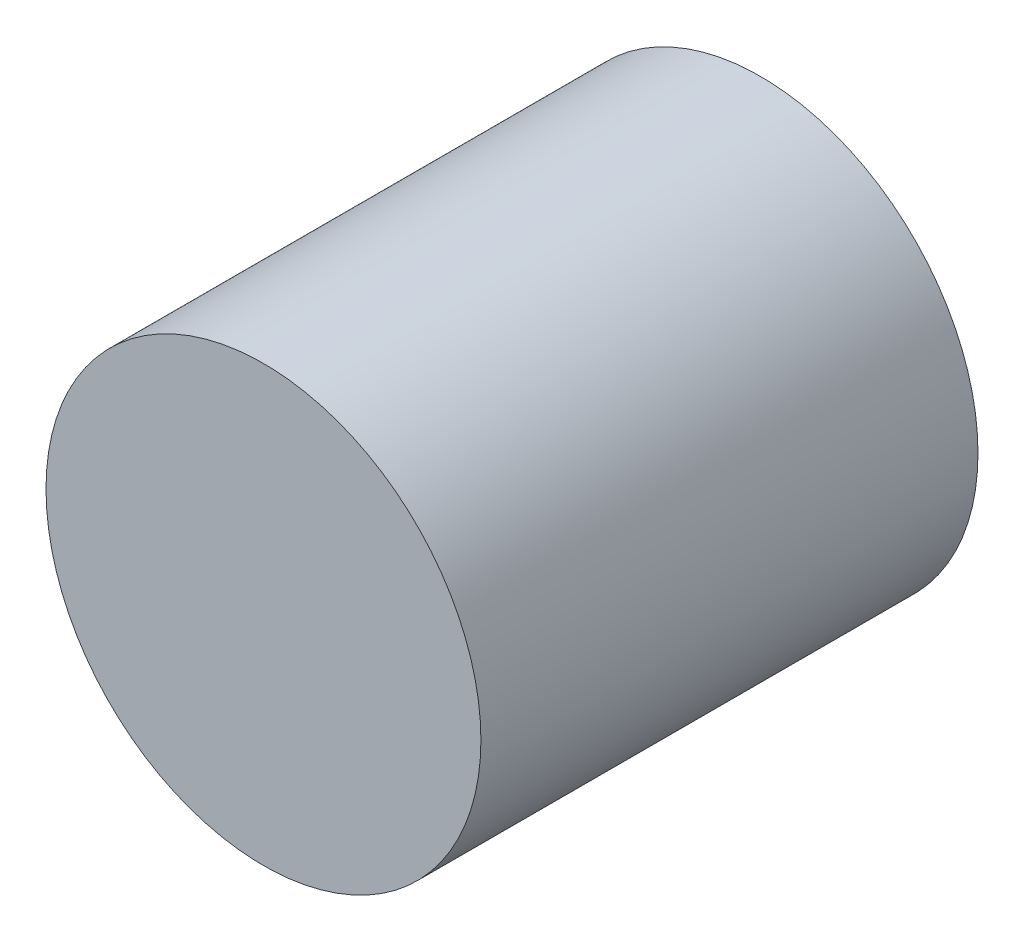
ISO-10303-21;
HEADER;
FILE_DESCRIPTION(('STEP AP214'),'2;1');
FILE_NAME('part.step','',(''),(''),'','','');
FILE_SCHEMA(('AUTOMOTIVE_DESIGN { 1 0 10303 214 1 1 1 1 }'));
ENDSEC;
DATA;
#1=APPLICATION_CONTEXT('core data for automotive mechanical design processes');
#2=APPLICATION_PROTOCOL_DEFINITION('international standard','automotive_design',2000,#1);
#3=PRODUCT_CONTEXT('',#1,'mechanical');
#4=PRODUCT('Part','Part','',(#3));
#5=PRODUCT_RELATED_PRODUCT_CATEGORY('part','',(#4));
#6=PRODUCT_DEFINITION_FORMATION('','',#4);
#7=PRODUCT_DEFINITION_CONTEXT('part definition',#1,'design');
#8=PRODUCT_DEFINITION('design','',#6,#7);
#9=PRODUCT_DEFINITION_SHAPE('','',#8);
#10=(LENGTH_UNIT() NAMED_UNIT(*) SI_UNIT(.MILLI.,.METRE.));
#11=(NAMED_UNIT(*) PLANE_ANGLE_UNIT() SI_UNIT($,.RADIAN.));
#12=(NAMED_UNIT(*) SI_UNIT($,.STERADIAN.) SOLID_ANGLE_UNIT());
#13=UNCERTAINTY_MEASURE_WITH_UNIT(LENGTH_MEASURE(1.E-05),#10,'distance_accuracy_value','');
#14=(GEOMETRIC_REPRESENTATION_CONTEXT(3) GLOBAL_UNCERTAINTY_ASSIGNED_CONTEXT((#13)) GLOBAL_UNIT_ASSIGNED_CONTEXT((#10,
#11,#12)) REPRESENTATION_CONTEXT('',''));
#15=CARTESIAN_POINT('',(0.,0.,0.));
#16=DIRECTION('',(0.,0.,1.));
#17=DIRECTION('',(1.,0.,0.));
#18=AXIS2_PLACEMENT_3D('',#15,#16,#17);
#19=CARTESIAN_POINT('',(0.,0.,0.));
#20=DIRECTION('',(0.,0.,1.));
#21=DIRECTION('',(1.,0.,0.));
#22=AXIS2_PLACEMENT_3D('',#19,#20,#21);
#23=PLANE('',#22);
#24=CARTESIAN_POINT('',(0.,5.08,0.));
#25=DIRECTION('',(0.,0.,1.));
#26=DIRECTION('',(1.,0.,0.));
#27=AXIS2_PLACEMENT_3D('',#24,#25,#26);
#28=CIRCLE('',#27,0.889);
#29=CARTESIAN_POINT('',(0.889,5.08,0.));
#30=VERTEX_POINT('',#29);
#31=EDGE_CURVE('E36',#30,#30,#28,.F.);
#32=ORIENTED_EDGE('',*,*,#31,.F.);
#33=EDGE_LOOP('',(#32));
#34=FACE_BOUND('',#33,.T.);
#35=CARTESIAN_POINT('',(0.,0.,0.));
#36=DIRECTION('',(0.,0.,1.));
#37=DIRECTION('',(1.,0.,0.));
#38=AXIS2_PLACEMENT_3D('',#35,#36,#37);
#39=CIRCLE('',#38,17.5006);
#40=CARTESIAN_POINT('',(17.5006,0.,0.));
#41=VERTEX_POINT('',#40);
#42=EDGE_CURVE('E44',#41,#41,#39,.T.);
#43=ORIENTED_EDGE('',*,*,#42,.F.);
#44=EDGE_LOOP('',(#43));
#45=FACE_BOUND('',#44,.T.);
#46=CARTESIAN_POINT('',(0.,-5.08,0.));
#47=DIRECTION('',(0.,0.,1.));
#48=DIRECTION('',(1.,0.,0.));
#49=AXIS2_PLACEMENT_3D('',#46,#47,#48);
#50=CIRCLE('',#49,0.889);
#51=CARTESIAN_POINT('',(0.889,-5.08,0.));
#52=VERTEX_POINT('',#51);
#53=EDGE_CURVE('E10',#52,#52,#50,.F.);
#54=ORIENTED_EDGE('',*,*,#53,.F.);
#55=EDGE_LOOP('',(#54));
#56=FACE_BOUND('',#55,.T.);
#57=ADVANCED_FACE('F29',(#34,#45,#56),#23,.F.);
#58=CARTESIAN_POINT('',(0.,0.,40.005));
#59=DIRECTION('',(0.,0.,-1.));
#60=DIRECTION('',(-1.,0.,0.));
#61=AXIS2_PLACEMENT_3D('',#58,#59,#60);
#62=CYLINDRICAL_SURFACE('',#61,17.5006);
#63=CARTESIAN_POINT('',(0.,0.,40.005));
#64=DIRECTION('',(0.,0.,1.));
#65=DIRECTION('',(1.,0.,0.));
#66=AXIS2_PLACEMENT_3D('',#63,#64,#65);
#67=CIRCLE('',#66,17.5006);
#68=CARTESIAN_POINT('',(17.5006,0.,40.005));
#69=VERTEX_POINT('',#68);
#70=EDGE_CURVE('E40',#69,#69,#67,.T.);
#71=ORIENTED_EDGE('',*,*,#70,.F.);
#72=EDGE_LOOP('',(#71));
#73=FACE_BOUND('',#72,.T.);
#74=ORIENTED_EDGE('',*,*,#42,.T.);
#75=EDGE_LOOP('',(#74));
#76=FACE_BOUND('',#75,.T.);
#77=ADVANCED_FACE('F31',(#73,#76),#62,.T.);
#78=CARTESIAN_POINT('',(0.,0.,40.005));
#79=DIRECTION('',(0.,0.,1.));
#80=DIRECTION('',(1.,0.,0.));
#81=AXIS2_PLACEMENT_3D('',#78,#79,#80);
#82=PLANE('',#81);
#83=ORIENTED_EDGE('',*,*,#70,.T.);
#84=EDGE_LOOP('',(#83));
#85=FACE_BOUND('',#84,.T.);
#86=ADVANCED_FACE('F75',(#85),#82,.T.);
#87=CARTESIAN_POINT('',(0.,5.08,-2.54));
#88=DIRECTION('',(0.,0.,1.));
#89=DIRECTION('',(1.,0.,0.));
#90=AXIS2_PLACEMENT_3D('',#87,#88,#89);
#91=CYLINDRICAL_SURFACE('',#90,0.889);
#92=CARTESIAN_POINT('',(0.,5.08,-2.54));
#93=DIRECTION('',(0.,0.,-1.));
#94=DIRECTION('',(-1.,0.,0.));
#95=AXIS2_PLACEMENT_3D('',#92,#93,#94);
#96=CIRCLE('',#95,0.889);
#97=CARTESIAN_POINT('',(-0.889,5.08,-2.54));
#98=VERTEX_POINT('',#97);
#99=EDGE_CURVE('E48',#98,#98,#96,.T.);
#100=ORIENTED_EDGE('',*,*,#99,.F.);
#101=EDGE_LOOP('',(#100));
#102=FACE_BOUND('',#101,.T.);
#103=ORIENTED_EDGE('',*,*,#31,.T.);
#104=EDGE_LOOP('',(#103));
#105=FACE_BOUND('',#104,.T.);
#106=ADVANCED_FACE('F67',(#102,#105),#91,.T.);
#107=CARTESIAN_POINT('',(0.,5.08,-2.54));
#108=DIRECTION('',(0.,0.,-1.));
#109=DIRECTION('',(-1.,0.,0.));
#110=AXIS2_PLACEMENT_3D('',#107,#108,#109);
#111=PLANE('',#110);
#112=ORIENTED_EDGE('',*,*,#99,.T.);
#113=EDGE_LOOP('',(#112));
#114=FACE_BOUND('',#113,.T.);
#115=ADVANCED_FACE('F60',(#114),#111,.T.);
#116=CARTESIAN_POINT('',(0.,-5.08,-2.54));
#117=DIRECTION('',(0.,0.,1.));
#118=DIRECTION('',(1.,0.,0.));
#119=AXIS2_PLACEMENT_3D('',#116,#117,#118);
#120=CYLINDRICAL_SURFACE('',#119,0.889);
#121=CARTESIAN_POINT('',(0.,-5.08,-2.54));
#122=DIRECTION('',(0.,0.,-1.));
#123=DIRECTION('',(-1.,0.,0.));
#124=AXIS2_PLACEMENT_3D('',#121,#122,#123);
#125=CIRCLE('',#124,0.889);
#126=CARTESIAN_POINT('',(-0.889,-5.08,-2.54));
#127=VERTEX_POINT('',#126);
#128=EDGE_CURVE('E52',#127,#127,#125,.T.);
#129=ORIENTED_EDGE('',*,*,#128,.F.);
#130=EDGE_LOOP('',(#129));
#131=FACE_BOUND('',#130,.T.);
#132=ORIENTED_EDGE('',*,*,#53,.T.);
#133=EDGE_LOOP('',(#132));
#134=FACE_BOUND('',#133,.T.);
#135=ADVANCED_FACE('F58',(#131,#134),#120,.T.);
#136=CARTESIAN_POINT('',(0.,-5.08,-2.54));
#137=DIRECTION('',(0.,0.,-1.));
#138=DIRECTION('',(-1.,0.,0.));
#139=AXIS2_PLACEMENT_3D('',#136,#137,#138);
#140=PLANE('',#139);
#141=ORIENTED_EDGE('',*,*,#128,.T.);
#142=EDGE_LOOP('',(#141));
#143=FACE_BOUND('',#142,.T.);
#144=ADVANCED_FACE('F56',(#143),#140,.T.);
#145=CLOSED_SHELL('',(#57,#77,#86,#106,#115,#135,#144));
#146=MANIFOLD_SOLID_BREP('B2',#145);
#147=ADVANCED_BREP_SHAPE_REPRESENTATION('',(#18,#146),#14);
#148=SHAPE_DEFINITION_REPRESENTATION(#9,#147);
ENDSEC;
END-ISO-10303-21;
